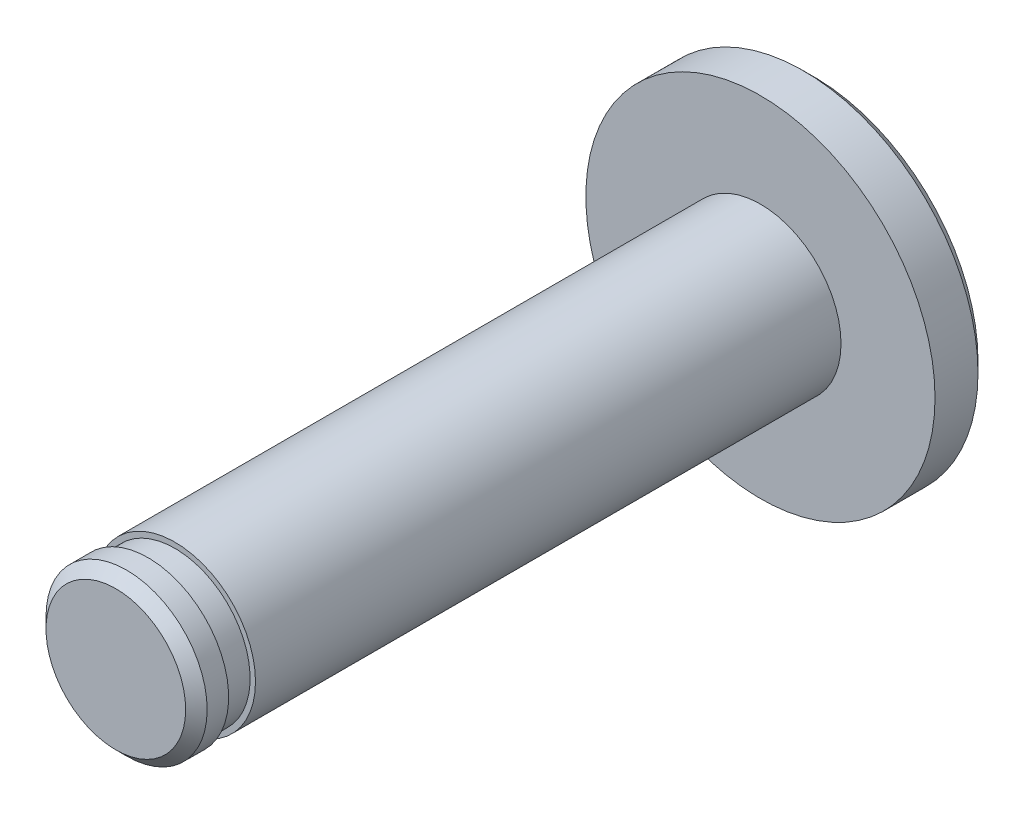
ISO-10303-21;
HEADER;
FILE_DESCRIPTION(('STEP AP214'),'2;1');
FILE_NAME('part.step','',(''),(''),'','','');
FILE_SCHEMA(('AUTOMOTIVE_DESIGN { 1 0 10303 214 1 1 1 1 }'));
ENDSEC;
DATA;
#1=APPLICATION_CONTEXT('core data for automotive mechanical design processes');
#2=APPLICATION_PROTOCOL_DEFINITION('international standard','automotive_design',2000,#1);
#3=PRODUCT_CONTEXT('',#1,'mechanical');
#4=PRODUCT('Part','Part','',(#3));
#5=PRODUCT_RELATED_PRODUCT_CATEGORY('part','',(#4));
#6=PRODUCT_DEFINITION_FORMATION('','',#4);
#7=PRODUCT_DEFINITION_CONTEXT('part definition',#1,'design');
#8=PRODUCT_DEFINITION('design','',#6,#7);
#9=PRODUCT_DEFINITION_SHAPE('','',#8);
#10=(LENGTH_UNIT() NAMED_UNIT(*) SI_UNIT(.MILLI.,.METRE.));
#11=(NAMED_UNIT(*) PLANE_ANGLE_UNIT() SI_UNIT($,.RADIAN.));
#12=(NAMED_UNIT(*) SI_UNIT($,.STERADIAN.) SOLID_ANGLE_UNIT());
#13=UNCERTAINTY_MEASURE_WITH_UNIT(LENGTH_MEASURE(1.E-05),#10,'distance_accuracy_value','');
#14=(GEOMETRIC_REPRESENTATION_CONTEXT(3) GLOBAL_UNCERTAINTY_ASSIGNED_CONTEXT((#13)) GLOBAL_UNIT_ASSIGNED_CONTEXT((#10,
#11,#12)) REPRESENTATION_CONTEXT('',''));
#15=CARTESIAN_POINT('',(0.,0.,0.));
#16=DIRECTION('',(0.,0.,1.));
#17=DIRECTION('',(1.,0.,0.));
#18=AXIS2_PLACEMENT_3D('',#15,#16,#17);
#19=CARTESIAN_POINT('',(0.,0.,13.));
#20=DIRECTION('',(0.,0.,-1.));
#21=DIRECTION('',(-1.,0.,0.));
#22=AXIS2_PLACEMENT_3D('',#19,#20,#21);
#23=CYLINDRICAL_SURFACE('',#22,1.5);
#24=CARTESIAN_POINT('',(0.,0.,1.));
#25=DIRECTION('',(0.,0.,1.));
#26=DIRECTION('',(1.,0.,0.));
#27=AXIS2_PLACEMENT_3D('',#24,#25,#26);
#28=CIRCLE('',#27,1.5);
#29=CARTESIAN_POINT('',(1.5,0.,1.));
#30=VERTEX_POINT('',#29);
#31=EDGE_CURVE('E55',#30,#30,#28,.T.);
#32=ORIENTED_EDGE('',*,*,#31,.T.);
#33=EDGE_LOOP('',(#32));
#34=FACE_BOUND('',#33,.T.);
#35=CARTESIAN_POINT('',(0.,0.,11.9));
#36=DIRECTION('',(0.,0.,1.));
#37=DIRECTION('',(1.,0.,0.));
#38=AXIS2_PLACEMENT_3D('',#35,#36,#37);
#39=CIRCLE('',#38,1.5);
#40=CARTESIAN_POINT('',(1.5,0.,11.9));
#41=VERTEX_POINT('',#40);
#42=EDGE_CURVE('E49',#41,#41,#39,.T.);
#43=ORIENTED_EDGE('',*,*,#42,.F.);
#44=EDGE_LOOP('',(#43));
#45=FACE_BOUND('',#44,.T.);
#46=ADVANCED_FACE('F30',(#34,#45),#23,.T.);
#47=CARTESIAN_POINT('',(0.,0.,1.));
#48=DIRECTION('',(0.,0.,1.));
#49=DIRECTION('',(1.,0.,0.));
#50=AXIS2_PLACEMENT_3D('',#47,#48,#49);
#51=PLANE('',#50);
#52=CARTESIAN_POINT('',(0.,0.,1.));
#53=DIRECTION('',(0.,0.,1.));
#54=DIRECTION('',(1.,0.,0.));
#55=AXIS2_PLACEMENT_3D('',#52,#53,#54);
#56=CIRCLE('',#55,3.25);
#57=CARTESIAN_POINT('',(3.25,0.,1.));
#58=VERTEX_POINT('',#57);
#59=EDGE_CURVE('E66',#58,#58,#56,.T.);
#60=ORIENTED_EDGE('',*,*,#59,.T.);
#61=EDGE_LOOP('',(#60));
#62=FACE_BOUND('',#61,.T.);
#63=ORIENTED_EDGE('',*,*,#31,.F.);
#64=EDGE_LOOP('',(#63));
#65=FACE_BOUND('',#64,.T.);
#66=ADVANCED_FACE('F85',(#62,#65),#51,.T.);
#67=CARTESIAN_POINT('',(0.,0.,1.));
#68=DIRECTION('',(0.,0.,-1.));
#69=DIRECTION('',(-1.,0.,0.));
#70=AXIS2_PLACEMENT_3D('',#67,#68,#69);
#71=CYLINDRICAL_SURFACE('',#70,3.25);
#72=CARTESIAN_POINT('',(0.,0.,0.2));
#73=DIRECTION('',(0.,0.,1.));
#74=DIRECTION('',(1.,0.,0.));
#75=AXIS2_PLACEMENT_3D('',#72,#73,#74);
#76=CIRCLE('',#75,3.25);
#77=CARTESIAN_POINT('',(3.25,0.,0.2));
#78=VERTEX_POINT('',#77);
#79=EDGE_CURVE('E69',#78,#78,#76,.T.);
#80=ORIENTED_EDGE('',*,*,#79,.T.);
#81=EDGE_LOOP('',(#80));
#82=FACE_BOUND('',#81,.T.);
#83=ORIENTED_EDGE('',*,*,#59,.F.);
#84=EDGE_LOOP('',(#83));
#85=FACE_BOUND('',#84,.T.);
#86=ADVANCED_FACE('F32',(#82,#85),#71,.T.);
#87=CARTESIAN_POINT('',(0.,0.,0.));
#88=DIRECTION('',(0.,0.,1.));
#89=DIRECTION('',(1.,0.,0.));
#90=AXIS2_PLACEMENT_3D('',#87,#88,#89);
#91=PLANE('',#90);
#92=CARTESIAN_POINT('',(0.,0.,0.));
#93=DIRECTION('',(0.,0.,1.));
#94=DIRECTION('',(1.,0.,0.));
#95=AXIS2_PLACEMENT_3D('',#92,#93,#94);
#96=CIRCLE('',#95,3.05);
#97=CARTESIAN_POINT('',(3.05,0.,0.));
#98=VERTEX_POINT('',#97);
#99=EDGE_CURVE('E46',#98,#98,#96,.F.);
#100=ORIENTED_EDGE('',*,*,#99,.T.);
#101=EDGE_LOOP('',(#100));
#102=FACE_BOUND('',#101,.T.);
#103=ADVANCED_FACE('F74',(#102),#91,.F.);
#104=CARTESIAN_POINT('',(0.,0.,0.2));
#105=DIRECTION('',(0.,0.,1.));
#106=DIRECTION('',(1.,0.,0.));
#107=AXIS2_PLACEMENT_3D('',#104,#105,#106);
#108=CONICAL_SURFACE('',#107,3.25,0.785398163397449);
#109=CARTESIAN_POINT('',(3.05,0.,0.));
#110=CARTESIAN_POINT('',(3.05208333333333,0.,0.00208333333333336));
#111=CARTESIAN_POINT('',(3.05416666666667,0.,0.00416666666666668));
#112=CARTESIAN_POINT('',(3.05833333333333,0.,0.00833333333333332));
#113=CARTESIAN_POINT('',(3.06041666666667,0.,0.0104166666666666));
#114=CARTESIAN_POINT('',(3.06458333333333,0.,0.0145833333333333));
#115=CARTESIAN_POINT('',(3.06666666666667,0.,0.0166666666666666));
#116=CARTESIAN_POINT('',(3.07083333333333,0.,0.0208333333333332));
#117=CARTESIAN_POINT('',(3.07291666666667,0.,0.0229166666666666));
#118=CARTESIAN_POINT('',(3.07708333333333,0.,0.0270833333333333));
#119=CARTESIAN_POINT('',(3.07916666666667,0.,0.0291666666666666));
#120=CARTESIAN_POINT('',(3.08333333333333,0.,0.0333333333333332));
#121=CARTESIAN_POINT('',(3.08541666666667,0.,0.0354166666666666));
#122=CARTESIAN_POINT('',(3.08958333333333,0.,0.0395833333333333));
#123=CARTESIAN_POINT('',(3.09166666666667,0.,0.0416666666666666));
#124=CARTESIAN_POINT('',(3.09583333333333,0.,0.0458333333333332));
#125=CARTESIAN_POINT('',(3.09791666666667,0.,0.0479166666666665));
#126=CARTESIAN_POINT('',(3.10208333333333,0.,0.0520833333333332));
#127=CARTESIAN_POINT('',(3.10416666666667,0.,0.0541666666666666));
#128=CARTESIAN_POINT('',(3.10833333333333,0.,0.0583333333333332));
#129=CARTESIAN_POINT('',(3.11041666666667,0.,0.0604166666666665));
#130=CARTESIAN_POINT('',(3.11458333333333,0.,0.0645833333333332));
#131=CARTESIAN_POINT('',(3.11666666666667,0.,0.0666666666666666));
#132=CARTESIAN_POINT('',(3.12083333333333,0.,0.0708333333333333));
#133=CARTESIAN_POINT('',(3.12291666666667,0.,0.0729166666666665));
#134=CARTESIAN_POINT('',(3.12708333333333,0.,0.0770833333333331));
#135=CARTESIAN_POINT('',(3.12916666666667,0.,0.0791666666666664));
#136=CARTESIAN_POINT('',(3.13333333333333,0.,0.0833333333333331));
#137=CARTESIAN_POINT('',(3.13541666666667,0.,0.0854166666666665));
#138=CARTESIAN_POINT('',(3.13958333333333,0.,0.0895833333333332));
#139=CARTESIAN_POINT('',(3.14166666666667,0.,0.0916666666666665));
#140=CARTESIAN_POINT('',(3.14583333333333,0.,0.0958333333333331));
#141=CARTESIAN_POINT('',(3.14791666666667,0.,0.0979166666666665));
#142=CARTESIAN_POINT('',(3.15208333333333,0.,0.102083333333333));
#143=CARTESIAN_POINT('',(3.15416666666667,0.,0.104166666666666));
#144=CARTESIAN_POINT('',(3.15833333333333,0.,0.108333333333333));
#145=CARTESIAN_POINT('',(3.16041666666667,0.,0.110416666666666));
#146=CARTESIAN_POINT('',(3.16458333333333,0.,0.114583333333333));
#147=CARTESIAN_POINT('',(3.16666666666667,0.,0.116666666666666));
#148=CARTESIAN_POINT('',(3.17083333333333,0.,0.120833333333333));
#149=CARTESIAN_POINT('',(3.17291666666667,0.,0.122916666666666));
#150=CARTESIAN_POINT('',(3.17708333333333,0.,0.127083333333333));
#151=CARTESIAN_POINT('',(3.17916666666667,0.,0.129166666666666));
#152=CARTESIAN_POINT('',(3.18333333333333,0.,0.133333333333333));
#153=CARTESIAN_POINT('',(3.18541666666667,0.,0.135416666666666));
#154=CARTESIAN_POINT('',(3.18958333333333,0.,0.139583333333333));
#155=CARTESIAN_POINT('',(3.19166666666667,0.,0.141666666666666));
#156=CARTESIAN_POINT('',(3.19583333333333,0.,0.145833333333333));
#157=CARTESIAN_POINT('',(3.19791666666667,0.,0.147916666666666));
#158=CARTESIAN_POINT('',(3.20208333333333,0.,0.152083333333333));
#159=CARTESIAN_POINT('',(3.20416666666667,0.,0.154166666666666));
#160=CARTESIAN_POINT('',(3.20833333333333,0.,0.158333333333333));
#161=CARTESIAN_POINT('',(3.21041666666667,0.,0.160416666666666));
#162=CARTESIAN_POINT('',(3.21458333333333,0.,0.164583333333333));
#163=CARTESIAN_POINT('',(3.21666666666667,0.,0.166666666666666));
#164=CARTESIAN_POINT('',(3.22083333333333,0.,0.170833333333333));
#165=CARTESIAN_POINT('',(3.22291666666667,0.,0.172916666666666));
#166=CARTESIAN_POINT('',(3.22708333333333,0.,0.177083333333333));
#167=CARTESIAN_POINT('',(3.22916666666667,0.,0.179166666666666));
#168=CARTESIAN_POINT('',(3.23333333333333,0.,0.183333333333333));
#169=CARTESIAN_POINT('',(3.23541666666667,0.,0.185416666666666));
#170=CARTESIAN_POINT('',(3.23958333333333,0.,0.189583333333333));
#171=CARTESIAN_POINT('',(3.24166666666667,0.,0.191666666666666));
#172=CARTESIAN_POINT('',(3.24583333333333,0.,0.195833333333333));
#173=CARTESIAN_POINT('',(3.24791666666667,0.,0.197916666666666));
#174=CARTESIAN_POINT('',(3.25,0.,0.2));
#175=B_SPLINE_CURVE_WITH_KNOTS('',3,(#109,#110,#111,#112,#113,#114,#115,#116,#117,#118,#119,
#120,#121,#122,#123,#124,#125,#126,#127,#128,#129,#130,#131,#132,#133,#134,#135,#136,#137,#138,
#139,#140,#141,#142,#143,#144,#145,#146,#147,#148,#149,#150,#151,#152,#153,#154,#155,#156,#157,
#158,#159,#160,#161,#162,#163,#164,#165,#166,#167,#168,#169,#170,#171,#172,#173,#174),
.UNSPECIFIED.,.F.,.F.,(4,2,2,2,2,2,2,2,2,2,2,2,2,2,2,2,2,2,2,2,2,2,2,2,2,2,2,2,2,2,2,2,4),(0.,
0.00883883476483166,0.0176776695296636,0.0265165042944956,0.0353553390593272,0.0441941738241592,
0.0530330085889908,0.0618718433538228,0.0707106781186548,0.0795495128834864,0.0883883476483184,
0.0972271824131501,0.106066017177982,0.114904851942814,0.123743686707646,0.132582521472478,
0.141421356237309,0.150260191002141,0.159099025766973,0.167937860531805,0.176776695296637,
0.185615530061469,0.194454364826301,0.203293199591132,0.212132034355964,0.220970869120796,
0.229809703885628,0.23864853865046,0.247487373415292,0.256326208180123,0.265165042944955,
0.274003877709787,0.282842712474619),.UNSPECIFIED.);
#176=EDGE_CURVE('BSEAM76',#98,#78,#175,.T.);
#177=ORIENTED_EDGE('',*,*,#99,.F.);
#178=ORIENTED_EDGE('',*,*,#79,.F.);
#179=ORIENTED_EDGE('',*,*,#176,.T.);
#180=ORIENTED_EDGE('',*,*,#176,.F.);
#181=EDGE_LOOP('',(#177,#179,#178,#180));
#182=FACE_BOUND('',#181,.T.);
#183=ADVANCED_FACE('F76',(#182),#108,.T.);
#184=CARTESIAN_POINT('',(1.7564870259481,0.,12.4));
#185=DIRECTION('',(0.,0.,-1.));
#186=DIRECTION('',(-1.,0.,0.));
#187=AXIS2_PLACEMENT_3D('',#184,#185,#186);
#188=PLANE('',#187);
#189=CARTESIAN_POINT('',(0.,0.,12.4));
#190=DIRECTION('',(0.,0.,-1.));
#191=DIRECTION('',(-1.,0.,0.));
#192=AXIS2_PLACEMENT_3D('',#189,#190,#191);
#193=CIRCLE('',#192,1.4);
#194=CARTESIAN_POINT('',(-1.4,0.,12.4));
#195=VERTEX_POINT('',#194);
#196=EDGE_CURVE('E51',#195,#195,#193,.T.);
#197=ORIENTED_EDGE('',*,*,#196,.F.);
#198=EDGE_LOOP('',(#197));
#199=FACE_BOUND('',#198,.T.);
#200=CARTESIAN_POINT('',(0.,0.,12.4));
#201=DIRECTION('',(0.,0.,-1.));
#202=DIRECTION('',(-1.,0.,0.));
#203=AXIS2_PLACEMENT_3D('',#200,#201,#202);
#204=CIRCLE('',#203,1.5);
#205=CARTESIAN_POINT('',(-1.5,0.,12.4));
#206=VERTEX_POINT('',#205);
#207=EDGE_CURVE('E34',#206,#206,#204,.T.);
#208=ORIENTED_EDGE('',*,*,#207,.T.);
#209=EDGE_LOOP('',(#208));
#210=FACE_BOUND('',#209,.T.);
#211=ADVANCED_FACE('F79',(#199,#210),#188,.T.);
#212=CARTESIAN_POINT('',(1.7564870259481,0.,11.9));
#213=DIRECTION('',(0.,0.,1.));
#214=DIRECTION('',(1.,0.,0.));
#215=AXIS2_PLACEMENT_3D('',#212,#213,#214);
#216=PLANE('',#215);
#217=CARTESIAN_POINT('',(0.,0.,11.9));
#218=DIRECTION('',(0.,0.,-1.));
#219=DIRECTION('',(-1.,0.,0.));
#220=AXIS2_PLACEMENT_3D('',#217,#218,#219);
#221=CIRCLE('',#220,1.4);
#222=CARTESIAN_POINT('',(-1.4,0.,11.9));
#223=VERTEX_POINT('',#222);
#224=EDGE_CURVE('E57',#223,#223,#221,.T.);
#225=ORIENTED_EDGE('',*,*,#224,.T.);
#226=EDGE_LOOP('',(#225));
#227=FACE_BOUND('',#226,.T.);
#228=ORIENTED_EDGE('',*,*,#42,.T.);
#229=EDGE_LOOP('',(#228));
#230=FACE_BOUND('',#229,.T.);
#231=ADVANCED_FACE('F112',(#227,#230),#216,.T.);
#232=CARTESIAN_POINT('',(0.,0.,0.));
#233=DIRECTION('',(0.,0.,-1.));
#234=DIRECTION('',(-1.,0.,0.));
#235=AXIS2_PLACEMENT_3D('',#232,#233,#234);
#236=CYLINDRICAL_SURFACE('',#235,1.4);
#237=ORIENTED_EDGE('',*,*,#196,.T.);
#238=EDGE_LOOP('',(#237));
#239=FACE_BOUND('',#238,.T.);
#240=ORIENTED_EDGE('',*,*,#224,.F.);
#241=EDGE_LOOP('',(#240));
#242=FACE_BOUND('',#241,.T.);
#243=ADVANCED_FACE('F118',(#239,#242),#236,.T.);
#244=CARTESIAN_POINT('',(0.,0.,13.));
#245=DIRECTION('',(0.,0.,1.));
#246=DIRECTION('',(1.,0.,0.));
#247=AXIS2_PLACEMENT_3D('',#244,#245,#246);
#248=PLANE('',#247);
#249=CARTESIAN_POINT('',(0.,0.,13.));
#250=DIRECTION('',(0.,0.,1.));
#251=DIRECTION('',(1.,0.,0.));
#252=AXIS2_PLACEMENT_3D('',#249,#250,#251);
#253=CIRCLE('',#252,1.3);
#254=CARTESIAN_POINT('',(1.3,0.,13.));
#255=VERTEX_POINT('',#254);
#256=EDGE_CURVE('E39',#255,#255,#253,.T.);
#257=ORIENTED_EDGE('',*,*,#256,.T.);
#258=EDGE_LOOP('',(#257));
#259=FACE_BOUND('',#258,.T.);
#260=ADVANCED_FACE('F105',(#259),#248,.T.);
#261=CARTESIAN_POINT('',(0.,0.,13.));
#262=DIRECTION('',(0.,0.,-1.));
#263=DIRECTION('',(-1.,0.,0.));
#264=AXIS2_PLACEMENT_3D('',#261,#262,#263);
#265=CONICAL_SURFACE('',#264,1.3,0.785398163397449);
#266=CARTESIAN_POINT('',(0.,0.,12.8));
#267=DIRECTION('',(0.,0.,1.));
#268=DIRECTION('',(1.,0.,0.));
#269=AXIS2_PLACEMENT_3D('',#266,#267,#268);
#270=CIRCLE('',#269,1.5);
#271=CARTESIAN_POINT('',(1.5,0.,12.8));
#272=VERTEX_POINT('',#271);
#273=EDGE_CURVE('E10',#272,#272,#270,.F.);
#274=ORIENTED_EDGE('',*,*,#273,.F.);
#275=EDGE_LOOP('',(#274));
#276=FACE_BOUND('',#275,.T.);
#277=ORIENTED_EDGE('',*,*,#256,.F.);
#278=EDGE_LOOP('',(#277));
#279=FACE_BOUND('',#278,.T.);
#280=ADVANCED_FACE('F101',(#276,#279),#265,.T.);
#281=ORIENTED_EDGE('',*,*,#273,.T.);
#282=EDGE_LOOP('',(#281));
#283=FACE_BOUND('',#282,.T.);
#284=ORIENTED_EDGE('',*,*,#207,.F.);
#285=EDGE_LOOP('',(#284));
#286=FACE_BOUND('',#285,.T.);
#287=ADVANCED_FACE('F95',(#283,#286),#23,.T.);
#288=CLOSED_SHELL('',(#46,#66,#86,#103,#183,#211,#231,#243,#260,#280,#287));
#289=MANIFOLD_SOLID_BREP('B2',#288);
#290=ADVANCED_BREP_SHAPE_REPRESENTATION('',(#18,#289),#14);
#291=SHAPE_DEFINITION_REPRESENTATION(#9,#290);
ENDSEC;
END-ISO-10303-21;
